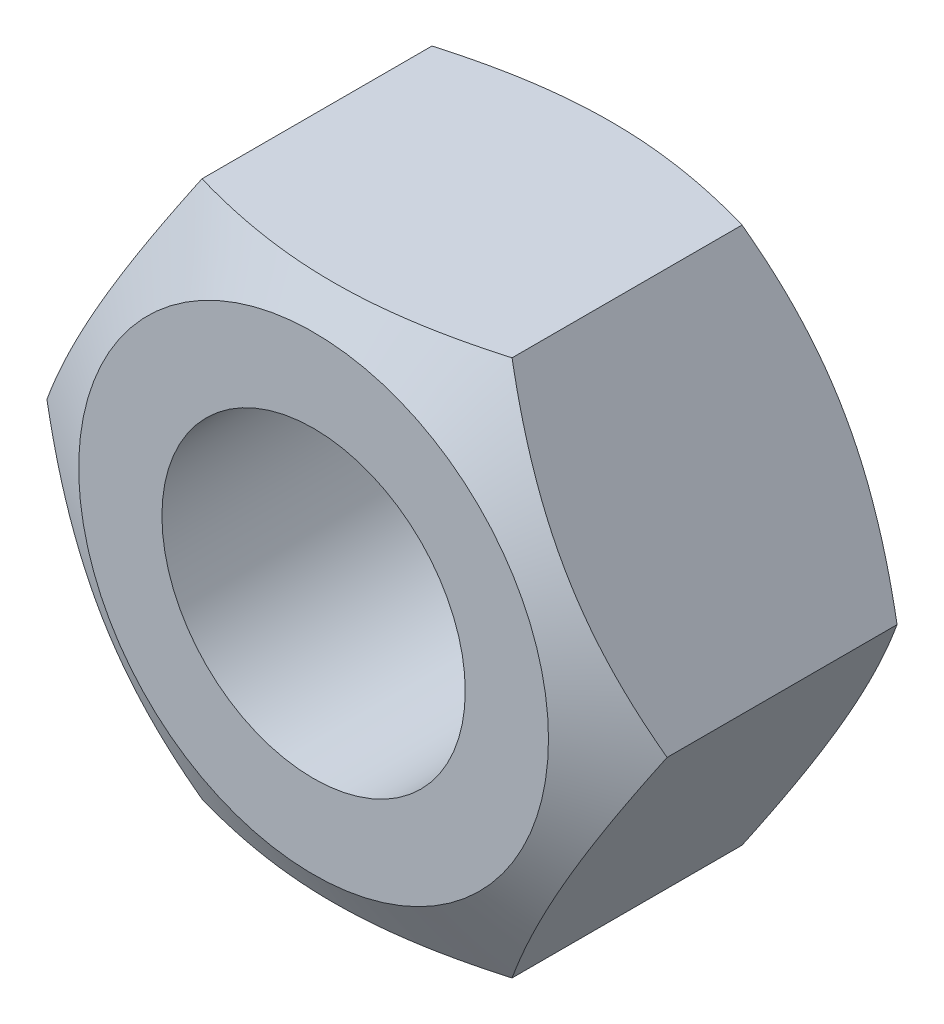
ISO-10303-21;
HEADER;
FILE_DESCRIPTION(('STEP AP214'),'2;1');
FILE_NAME('part.step','',(''),(''),'','','');
FILE_SCHEMA(('AUTOMOTIVE_DESIGN { 1 0 10303 214 1 1 1 1 }'));
ENDSEC;
DATA;
#1=APPLICATION_CONTEXT('core data for automotive mechanical design processes');
#2=APPLICATION_PROTOCOL_DEFINITION('international standard','automotive_design',2000,#1);
#3=PRODUCT_CONTEXT('',#1,'mechanical');
#4=PRODUCT('Part','Part','',(#3));
#5=PRODUCT_RELATED_PRODUCT_CATEGORY('part','',(#4));
#6=PRODUCT_DEFINITION_FORMATION('','',#4);
#7=PRODUCT_DEFINITION_CONTEXT('part definition',#1,'design');
#8=PRODUCT_DEFINITION('design','',#6,#7);
#9=PRODUCT_DEFINITION_SHAPE('','',#8);
#10=(LENGTH_UNIT() NAMED_UNIT(*) SI_UNIT(.MILLI.,.METRE.));
#11=(NAMED_UNIT(*) PLANE_ANGLE_UNIT() SI_UNIT($,.RADIAN.));
#12=(NAMED_UNIT(*) SI_UNIT($,.STERADIAN.) SOLID_ANGLE_UNIT());
#13=UNCERTAINTY_MEASURE_WITH_UNIT(LENGTH_MEASURE(1.E-05),#10,'distance_accuracy_value','');
#14=(GEOMETRIC_REPRESENTATION_CONTEXT(3) GLOBAL_UNCERTAINTY_ASSIGNED_CONTEXT((#13)) GLOBAL_UNIT_ASSIGNED_CONTEXT((#10,
#11,#12)) REPRESENTATION_CONTEXT('',''));
#15=CARTESIAN_POINT('',(0.,0.,0.));
#16=DIRECTION('',(0.,0.,1.));
#17=DIRECTION('',(1.,0.,0.));
#18=AXIS2_PLACEMENT_3D('',#15,#16,#17);
#19=CARTESIAN_POINT('',(0.,0.,0.644));
#20=DIRECTION('',(0.,0.,1.));
#21=DIRECTION('',(1.,0.,0.));
#22=AXIS2_PLACEMENT_3D('',#19,#20,#21);
#23=CONICAL_SURFACE('',#22,4.6,1.0471975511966);
#24=CARTESIAN_POINT('',(0.,0.,0.));
#25=DIRECTION('',(0.,0.,1.));
#26=DIRECTION('',(1.,0.,0.));
#27=AXIS2_PLACEMENT_3D('',#24,#25,#26);
#28=CIRCLE('',#27,3.48455927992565);
#29=CARTESIAN_POINT('',(3.48455927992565,0.,0.));
#30=VERTEX_POINT('',#29);
#31=EDGE_CURVE('E214',#30,#30,#28,.F.);
#32=ORIENTED_EDGE('',*,*,#31,.F.);
#33=EDGE_LOOP('',(#32));
#34=FACE_BOUND('',#33,.T.);
#35=CARTESIAN_POINT('',(2.29988452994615,3.98391685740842,0.644066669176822));
#36=CARTESIAN_POINT('',(2.40095754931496,3.80885325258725,0.585690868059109));
#37=CARTESIAN_POINT('',(2.50290302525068,3.63227850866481,0.532600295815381));
#38=CARTESIAN_POINT('',(2.70855925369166,3.27607147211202,0.439930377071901));
#39=CARTESIAN_POINT('',(2.81227366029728,3.09643285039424,0.400383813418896));
#40=CARTESIAN_POINT('',(3.01841713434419,2.73938187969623,0.338824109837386));
#41=CARTESIAN_POINT('',(3.12081448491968,2.56202446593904,0.316401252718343));
#42=CARTESIAN_POINT('',(3.32609097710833,2.20647515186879,0.289633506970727));
#43=CARTESIAN_POINT('',(3.42896937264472,2.0282845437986,0.28526645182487));
#44=CARTESIAN_POINT('',(3.62120183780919,1.69532814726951,0.294353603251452));
#45=CARTESIAN_POINT('',(3.71058469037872,1.54051250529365,0.305576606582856));
#46=CARTESIAN_POINT('',(3.88876806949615,1.23188983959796,0.341146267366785));
#47=CARTESIAN_POINT('',(3.97756797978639,1.07808388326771,0.365505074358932));
#48=CARTESIAN_POINT('',(4.15611871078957,0.768824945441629,0.426399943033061));
#49=CARTESIAN_POINT('',(4.2458469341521,0.613411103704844,0.463194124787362));
#50=CARTESIAN_POINT('',(4.42396513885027,0.304901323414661,0.54670234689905));
#51=CARTESIAN_POINT('',(4.51235740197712,0.151801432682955,0.593396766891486));
#52=CARTESIAN_POINT('',(4.60011547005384,-0.000200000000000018,0.644066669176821));
#53=B_SPLINE_CURVE_WITH_KNOTS('',3,(#35,#36,#37,#38,#39,#40,#41,#42,#43,#44,#45,#46,#47,#48,#49,
#50,#51,#52),.UNSPECIFIED.,.F.,.F.,(4,2,2,2,2,2,2,2,4),(0.,0.631466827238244,1.26445147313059,
1.8817701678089,2.49833077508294,3.03517287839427,3.57251237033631,4.12177063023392,
4.66995037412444),.UNSPECIFIED.);
#54=CARTESIAN_POINT('',(2.29999999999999,3.98371685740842,0.643999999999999));
#55=VERTEX_POINT('',#54);
#56=CARTESIAN_POINT('',(4.6,0.,0.644));
#57=VERTEX_POINT('',#56);
#58=EDGE_CURVE('E90',#55,#57,#53,.T.);
#59=ORIENTED_EDGE('',*,*,#58,.T.);
#60=CARTESIAN_POINT('',(4.60011547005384,0.0002,0.644066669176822));
#61=CARTESIAN_POINT('',(4.49904245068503,-0.174863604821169,0.585690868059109));
#62=CARTESIAN_POINT('',(4.39709697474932,-0.351438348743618,0.532600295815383));
#63=CARTESIAN_POINT('',(4.19144074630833,-0.707645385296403,0.439930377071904));
#64=CARTESIAN_POINT('',(4.08772633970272,-0.88728400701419,0.4003838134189));
#65=CARTESIAN_POINT('',(3.88158286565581,-1.2443349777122,0.338824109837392));
#66=CARTESIAN_POINT('',(3.77918551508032,-1.42169239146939,0.316401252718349));
#67=CARTESIAN_POINT('',(3.57390902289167,-1.77724170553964,0.289633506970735));
#68=CARTESIAN_POINT('',(3.47103062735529,-1.95543231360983,0.28526645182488));
#69=CARTESIAN_POINT('',(3.27879816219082,-2.28838871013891,0.294353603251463));
#70=CARTESIAN_POINT('',(3.18941530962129,-2.44320435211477,0.305576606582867));
#71=CARTESIAN_POINT('',(3.01123193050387,-2.75182701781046,0.341146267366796));
#72=CARTESIAN_POINT('',(2.92243202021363,-2.9056329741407,0.365505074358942));
#73=CARTESIAN_POINT('',(2.74388128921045,-3.21489191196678,0.426399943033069));
#74=CARTESIAN_POINT('',(2.65415306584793,-3.37030575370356,0.463194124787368));
#75=CARTESIAN_POINT('',(2.47603486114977,-3.67881553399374,0.546702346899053));
#76=CARTESIAN_POINT('',(2.38764259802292,-3.83191542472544,0.593396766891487));
#77=CARTESIAN_POINT('',(2.29988452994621,-3.98391685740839,0.644066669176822));
#78=B_SPLINE_CURVE_WITH_KNOTS('',3,(#60,#61,#62,#63,#64,#65,#66,#67,#68,#69,#70,#71,#72,#73,#74,
#75,#76,#77),.UNSPECIFIED.,.F.,.F.,(4,2,2,2,2,2,2,2,4),(0.,0.631466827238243,1.26445147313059,
1.8817701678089,2.49833077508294,3.03517287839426,3.57251237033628,4.12177063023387,
4.66995037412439),.UNSPECIFIED.);
#79=CARTESIAN_POINT('',(2.30000000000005,-3.98371685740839,0.644));
#80=VERTEX_POINT('',#79);
#81=EDGE_CURVE('E179',#57,#80,#78,.T.);
#82=ORIENTED_EDGE('',*,*,#81,.T.);
#83=CARTESIAN_POINT('',(-6.0600576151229,-3.98371685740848,2.17524414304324));
#84=CARTESIAN_POINT('',(-5.88700534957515,-3.98371685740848,2.09178000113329));
#85=CARTESIAN_POINT('',(-5.71354286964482,-3.98371685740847,2.00915113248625));
#86=CARTESIAN_POINT('',(-5.36557882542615,-3.98371685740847,1.84603631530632));
#87=CARTESIAN_POINT('',(-5.19107709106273,-3.98371685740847,1.76555073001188));
#88=CARTESIAN_POINT('',(-4.83985881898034,-3.98371685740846,1.60676430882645));
#89=CARTESIAN_POINT('',(-4.6631353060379,-3.98371685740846,1.52847884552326));
#90=CARTESIAN_POINT('',(-4.30824051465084,-3.98371685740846,1.3752739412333));
#91=CARTESIAN_POINT('',(-4.1300693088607,-3.98371685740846,1.30035433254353));
#92=CARTESIAN_POINT('',(-3.76674341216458,-3.98371685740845,1.15263847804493));
#93=CARTESIAN_POINT('',(-3.58153701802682,-3.98371685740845,1.07996867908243));
#94=CARTESIAN_POINT('',(-3.20891432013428,-3.98371685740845,0.940420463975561));
#95=CARTESIAN_POINT('',(-3.02149776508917,-3.98371685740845,0.873542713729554));
#96=CARTESIAN_POINT('',(-2.64454732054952,-3.98371685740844,0.747421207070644));
#97=CARTESIAN_POINT('',(-2.45501902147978,-3.98371685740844,0.6881609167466));
#98=CARTESIAN_POINT('',(-2.07324771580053,-3.98371685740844,0.57925304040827));
#99=CARTESIAN_POINT('',(-1.88100562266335,-3.98371685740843,0.529602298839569));
#100=CARTESIAN_POINT('',(-1.49472880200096,-3.98371685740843,0.442626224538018));
#101=CARTESIAN_POINT('',(-1.30070817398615,-3.98371685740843,0.405239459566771));
#102=CARTESIAN_POINT('',(-0.910383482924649,-3.98371685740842,0.344987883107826));
#103=CARTESIAN_POINT('',(-0.714079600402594,-3.98371685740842,0.322121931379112));
#104=CARTESIAN_POINT('',(-0.322680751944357,-3.98371685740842,0.293036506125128));
#105=CARTESIAN_POINT('',(-0.127601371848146,-3.98371685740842,0.286612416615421));
#106=CARTESIAN_POINT('',(0.262406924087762,-3.98371685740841,0.290423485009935));
#107=CARTESIAN_POINT('',(0.457335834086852,-3.98371685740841,0.300659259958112));
#108=CARTESIAN_POINT('',(0.791872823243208,-3.98371685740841,0.331817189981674));
#109=CARTESIAN_POINT('',(0.931848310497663,-3.98371685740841,0.348993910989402));
#110=CARTESIAN_POINT('',(1.21068944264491,-3.9837168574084,0.390802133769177));
#111=CARTESIAN_POINT('',(1.34955491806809,-3.9837168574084,0.415434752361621));
#112=CARTESIAN_POINT('',(1.76434873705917,-3.9837168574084,0.499212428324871));
#113=CARTESIAN_POINT('',(2.03830287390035,-3.98371685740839,0.568219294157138));
#114=CARTESIAN_POINT('',(2.44782308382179,-3.98371685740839,0.686799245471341));
#115=CARTESIAN_POINT('',(2.58553682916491,-3.98371685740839,0.729368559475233));
#116=CARTESIAN_POINT('',(2.85962528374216,-3.98371685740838,0.818657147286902));
#117=CARTESIAN_POINT('',(2.99599998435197,-3.98371685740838,0.865376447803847));
#118=CARTESIAN_POINT('',(3.26745921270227,-3.98371685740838,0.962238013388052));
#119=CARTESIAN_POINT('',(3.40254420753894,-3.98371685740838,1.01237898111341));
#120=CARTESIAN_POINT('',(3.67161322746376,-3.98371685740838,1.11552148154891));
#121=CARTESIAN_POINT('',(3.80559726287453,-3.98371685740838,1.16852298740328));
#122=CARTESIAN_POINT('',(4.11044155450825,-3.98371685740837,1.29227010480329));
#123=CARTESIAN_POINT('',(4.28098828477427,-3.98371685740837,1.363786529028));
#124=CARTESIAN_POINT('',(4.62073745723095,-3.98371685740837,1.50995090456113));
#125=CARTESIAN_POINT('',(4.78993983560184,-3.98371685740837,1.58459900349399));
#126=CARTESIAN_POINT('',(5.29591087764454,-3.98371685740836,1.81231195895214));
#127=CARTESIAN_POINT('',(5.6309914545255,-3.98371685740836,1.96912390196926));
#128=CARTESIAN_POINT('',(6.29823817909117,-3.98371685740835,2.28949405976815));
#129=CARTESIAN_POINT('',(6.63040154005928,-3.98371685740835,2.45305802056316));
#130=CARTESIAN_POINT('',(7.29242379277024,-3.98371685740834,2.7848000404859));
#131=CARTESIAN_POINT('',(7.62228261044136,-3.98371685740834,2.95297824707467));
#132=CARTESIAN_POINT('',(8.25466049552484,-3.98371685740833,3.27940856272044));
#133=CARTESIAN_POINT('',(8.55730763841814,-3.98371685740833,3.43741335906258));
#134=CARTESIAN_POINT('',(9.16148889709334,-3.98371685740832,3.75555530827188));
#135=CARTESIAN_POINT('',(9.46302298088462,-3.98371685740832,3.91569252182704));
#136=CARTESIAN_POINT('',(10.0645707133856,-3.98371685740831,4.23725971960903));
#137=CARTESIAN_POINT('',(10.3645862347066,-3.98371685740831,4.39868620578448));
#138=CARTESIAN_POINT('',(10.9638991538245,-3.9837168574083,4.7228334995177));
#139=CARTESIAN_POINT('',(11.263196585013,-3.9837168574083,4.88555424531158));
#140=CARTESIAN_POINT('',(11.562226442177,-3.98371685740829,5.0487619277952));
#141=B_SPLINE_CURVE_WITH_KNOTS('',3,(#83,#84,#85,#86,#87,#88,#89,#90,#91,#92,#93,#94,#95,#96,
#97,#98,#99,#100,#101,#102,#103,#104,#105,#106,#107,#108,#109,#110,#111,#112,#113,#114,#115,
#116,#117,#118,#119,#120,#121,#122,#123,#124,#125,#126,#127,#128,#129,#130,#131,#132,#133,#134,
#135,#136,#137,#138,#139,#140),.UNSPECIFIED.,.F.,.F.,(4,2,2,2,2,2,2,2,2,2,2,2,2,2,2,2,2,2,2,2,2,
2,2,2,2,2,2,2,4),(0.,0.576393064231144,1.15288320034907,1.73271577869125,2.31251943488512,
2.90930373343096,3.50615655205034,4.10169118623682,4.6970299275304,5.28933928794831,
5.88160213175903,6.46645771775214,7.05133496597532,7.47420386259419,7.89713613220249,
8.74351598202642,9.1759122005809,9.60831120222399,10.0405471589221,10.4727790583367,
11.0275413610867,11.5823298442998,12.6920756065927,13.8027860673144,14.9135320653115,
15.9377522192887,16.9620015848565,17.9840600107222,19.0060699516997),.UNSPECIFIED.);
#142=CARTESIAN_POINT('',(-2.29999999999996,-3.98371685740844,0.643999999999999));
#143=VERTEX_POINT('',#142);
#144=EDGE_CURVE('E173',#80,#143,#141,.F.);
#145=ORIENTED_EDGE('',*,*,#144,.T.);
#146=CARTESIAN_POINT('',(-2.29988452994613,-3.98391685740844,0.644066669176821));
#147=CARTESIAN_POINT('',(-2.40095754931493,-3.80885325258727,0.585690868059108));
#148=CARTESIAN_POINT('',(-2.50290302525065,-3.63227850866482,0.532600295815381));
#149=CARTESIAN_POINT('',(-2.70855925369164,-3.27607147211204,0.439930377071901));
#150=CARTESIAN_POINT('',(-2.81227366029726,-3.09643285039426,0.400383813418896));
#151=CARTESIAN_POINT('',(-3.01841713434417,-2.73938187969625,0.338824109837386));
#152=CARTESIAN_POINT('',(-3.12081448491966,-2.56202446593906,0.316401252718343));
#153=CARTESIAN_POINT('',(-3.32609097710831,-2.20647515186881,0.289633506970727));
#154=CARTESIAN_POINT('',(-3.4289693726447,-2.02828454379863,0.28526645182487));
#155=CARTESIAN_POINT('',(-3.62120183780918,-1.69532814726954,0.294353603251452));
#156=CARTESIAN_POINT('',(-3.71058469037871,-1.54051250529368,0.305576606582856));
#157=CARTESIAN_POINT('',(-3.88876806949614,-1.23188983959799,0.341146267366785));
#158=CARTESIAN_POINT('',(-3.97756797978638,-1.07808388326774,0.365505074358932));
#159=CARTESIAN_POINT('',(-4.15611871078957,-0.768824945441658,0.42639994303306));
#160=CARTESIAN_POINT('',(-4.2458469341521,-0.613411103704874,0.463194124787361));
#161=CARTESIAN_POINT('',(-4.42396513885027,-0.304901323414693,0.546702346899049));
#162=CARTESIAN_POINT('',(-4.51235740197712,-0.151801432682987,0.593396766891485));
#163=CARTESIAN_POINT('',(-4.60011547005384,0.000199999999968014,0.644066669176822));
#164=B_SPLINE_CURVE_WITH_KNOTS('',3,(#146,#147,#148,#149,#150,#151,#152,#153,#154,#155,#156,
#157,#158,#159,#160,#161,#162,#163),.UNSPECIFIED.,.F.,.F.,(4,2,2,2,2,2,2,2,4),(0.,
0.631466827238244,1.26445147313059,1.8817701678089,2.49833077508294,3.03517287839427,
3.57251237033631,4.12177063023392,4.66995037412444),.UNSPECIFIED.);
#165=CARTESIAN_POINT('',(-4.6,0.,0.644));
#166=VERTEX_POINT('',#165);
#167=EDGE_CURVE('E111',#143,#166,#164,.T.);
#168=ORIENTED_EDGE('',*,*,#167,.T.);
#169=CARTESIAN_POINT('',(-4.60011547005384,-0.000200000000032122,0.644066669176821));
#170=CARTESIAN_POINT('',(-4.49904245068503,0.174863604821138,0.585690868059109));
#171=CARTESIAN_POINT('',(-4.39709697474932,0.351438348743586,0.532600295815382));
#172=CARTESIAN_POINT('',(-4.19144074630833,0.70764538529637,0.439930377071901));
#173=CARTESIAN_POINT('',(-4.08772633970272,0.887284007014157,0.400383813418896));
#174=CARTESIAN_POINT('',(-3.88158286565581,1.24433497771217,0.338824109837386));
#175=CARTESIAN_POINT('',(-3.77918551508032,1.42169239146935,0.316401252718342));
#176=CARTESIAN_POINT('',(-3.57390902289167,1.77724170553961,0.289633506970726));
#177=CARTESIAN_POINT('',(-3.47103062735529,1.95543231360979,0.28526645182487));
#178=CARTESIAN_POINT('',(-3.27879816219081,2.28838871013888,0.294353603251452));
#179=CARTESIAN_POINT('',(-3.18941530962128,2.44320435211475,0.305576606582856));
#180=CARTESIAN_POINT('',(-3.01123193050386,2.75182701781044,0.341146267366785));
#181=CARTESIAN_POINT('',(-2.92243202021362,2.90563297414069,0.365505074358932));
#182=CARTESIAN_POINT('',(-2.74388128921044,3.21489191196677,0.426399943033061));
#183=CARTESIAN_POINT('',(-2.65415306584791,3.37030575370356,0.463194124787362));
#184=CARTESIAN_POINT('',(-2.47603486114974,3.67881553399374,0.54670234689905));
#185=CARTESIAN_POINT('',(-2.38764259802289,3.83191542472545,0.593396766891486));
#186=CARTESIAN_POINT('',(-2.29988452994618,3.98391685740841,0.644066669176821));
#187=B_SPLINE_CURVE_WITH_KNOTS('',3,(#169,#170,#171,#172,#173,#174,#175,#176,#177,#178,#179,
#180,#181,#182,#183,#184,#185,#186),.UNSPECIFIED.,.F.,.F.,(4,2,2,2,2,2,2,2,4),(0.,
0.631466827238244,1.26445147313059,1.8817701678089,2.49833077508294,3.03517287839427,
3.57251237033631,4.12177063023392,4.66995037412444),.UNSPECIFIED.);
#188=CARTESIAN_POINT('',(-2.30000000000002,3.98371685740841,0.643999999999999));
#189=VERTEX_POINT('',#188);
#190=EDGE_CURVE('E109',#166,#189,#187,.T.);
#191=ORIENTED_EDGE('',*,*,#190,.T.);
#192=CARTESIAN_POINT('',(-6.06005761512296,3.98371685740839,2.17524414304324));
#193=CARTESIAN_POINT('',(-5.8870053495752,3.98371685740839,2.09178000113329));
#194=CARTESIAN_POINT('',(-5.71354286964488,3.98371685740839,2.00915113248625));
#195=CARTESIAN_POINT('',(-5.3655788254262,3.9837168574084,1.84603631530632));
#196=CARTESIAN_POINT('',(-5.19107709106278,3.9837168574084,1.76555073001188));
#197=CARTESIAN_POINT('',(-4.83985881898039,3.9837168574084,1.60676430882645));
#198=CARTESIAN_POINT('',(-4.66313530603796,3.9837168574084,1.52847884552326));
#199=CARTESIAN_POINT('',(-4.3082405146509,3.9837168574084,1.3752739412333));
#200=CARTESIAN_POINT('',(-4.13006930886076,3.9837168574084,1.30035433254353));
#201=CARTESIAN_POINT('',(-3.76674341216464,3.9837168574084,1.15263847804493));
#202=CARTESIAN_POINT('',(-3.58153701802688,3.9837168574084,1.07996867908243));
#203=CARTESIAN_POINT('',(-3.20891432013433,3.9837168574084,0.940420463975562));
#204=CARTESIAN_POINT('',(-3.02149776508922,3.9837168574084,0.873542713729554));
#205=CARTESIAN_POINT('',(-2.64454732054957,3.98371685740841,0.747421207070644));
#206=CARTESIAN_POINT('',(-2.45501902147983,3.98371685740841,0.688160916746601));
#207=CARTESIAN_POINT('',(-2.07324771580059,3.98371685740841,0.579253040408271));
#208=CARTESIAN_POINT('',(-1.88100562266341,3.98371685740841,0.529602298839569));
#209=CARTESIAN_POINT('',(-1.49472880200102,3.98371685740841,0.442626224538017));
#210=CARTESIAN_POINT('',(-1.30070817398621,3.98371685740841,0.405239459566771));
#211=CARTESIAN_POINT('',(-0.910383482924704,3.98371685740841,0.344987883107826));
#212=CARTESIAN_POINT('',(-0.714079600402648,3.98371685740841,0.322121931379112));
#213=CARTESIAN_POINT('',(-0.322680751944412,3.98371685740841,0.293036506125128));
#214=CARTESIAN_POINT('',(-0.127601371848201,3.98371685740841,0.286612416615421));
#215=CARTESIAN_POINT('',(0.262406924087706,3.98371685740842,0.290423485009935));
#216=CARTESIAN_POINT('',(0.457335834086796,3.98371685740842,0.300659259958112));
#217=CARTESIAN_POINT('',(0.791872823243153,3.98371685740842,0.331817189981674));
#218=CARTESIAN_POINT('',(0.931848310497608,3.98371685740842,0.348993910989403));
#219=CARTESIAN_POINT('',(1.21068944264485,3.98371685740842,0.390802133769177));
#220=CARTESIAN_POINT('',(1.34955491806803,3.98371685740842,0.415434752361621));
#221=CARTESIAN_POINT('',(1.76434873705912,3.98371685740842,0.499212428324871));
#222=CARTESIAN_POINT('',(2.03830287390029,3.98371685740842,0.568219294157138));
#223=CARTESIAN_POINT('',(2.44782308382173,3.98371685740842,0.68679924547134));
#224=CARTESIAN_POINT('',(2.58553682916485,3.98371685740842,0.729368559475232));
#225=CARTESIAN_POINT('',(2.8596252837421,3.98371685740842,0.818657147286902));
#226=CARTESIAN_POINT('',(2.99599998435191,3.98371685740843,0.865376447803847));
#227=CARTESIAN_POINT('',(3.26745921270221,3.98371685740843,0.962238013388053));
#228=CARTESIAN_POINT('',(3.40254420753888,3.98371685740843,1.01237898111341));
#229=CARTESIAN_POINT('',(3.67161322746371,3.98371685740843,1.11552148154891));
#230=CARTESIAN_POINT('',(3.80559726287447,3.98371685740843,1.16852298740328));
#231=CARTESIAN_POINT('',(4.1104415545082,3.98371685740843,1.29227010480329));
#232=CARTESIAN_POINT('',(4.28098828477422,3.98371685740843,1.363786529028));
#233=CARTESIAN_POINT('',(4.62073745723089,3.98371685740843,1.50995090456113));
#234=CARTESIAN_POINT('',(4.78993983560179,3.98371685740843,1.58459900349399));
#235=CARTESIAN_POINT('',(5.29591087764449,3.98371685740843,1.81231195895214));
#236=CARTESIAN_POINT('',(5.63099145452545,3.98371685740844,1.96912390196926));
#237=CARTESIAN_POINT('',(6.29823817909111,3.98371685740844,2.28949405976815));
#238=CARTESIAN_POINT('',(6.63040154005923,3.98371685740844,2.45305802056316));
#239=CARTESIAN_POINT('',(7.29242379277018,3.98371685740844,2.7848000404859));
#240=CARTESIAN_POINT('',(7.62228261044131,3.98371685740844,2.95297824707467));
#241=CARTESIAN_POINT('',(8.25466049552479,3.98371685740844,3.27940856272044));
#242=CARTESIAN_POINT('',(8.55730763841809,3.98371685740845,3.43741335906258));
#243=CARTESIAN_POINT('',(9.16148889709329,3.98371685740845,3.75555530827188));
#244=CARTESIAN_POINT('',(9.46302298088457,3.98371685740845,3.91569252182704));
#245=CARTESIAN_POINT('',(10.0645707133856,3.98371685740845,4.23725971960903));
#246=CARTESIAN_POINT('',(10.3645862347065,3.98371685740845,4.39868620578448));
#247=CARTESIAN_POINT('',(10.9638991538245,3.98371685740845,4.7228334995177));
#248=CARTESIAN_POINT('',(11.263196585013,3.98371685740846,4.88555424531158));
#249=CARTESIAN_POINT('',(11.5622264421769,3.98371685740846,5.0487619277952));
#250=B_SPLINE_CURVE_WITH_KNOTS('',3,(#192,#193,#194,#195,#196,#197,#198,#199,#200,#201,#202,
#203,#204,#205,#206,#207,#208,#209,#210,#211,#212,#213,#214,#215,#216,#217,#218,#219,#220,#221,
#222,#223,#224,#225,#226,#227,#228,#229,#230,#231,#232,#233,#234,#235,#236,#237,#238,#239,#240,
#241,#242,#243,#244,#245,#246,#247,#248,#249),.UNSPECIFIED.,.F.,.F.,(4,2,2,2,2,2,2,2,2,2,2,2,2,
2,2,2,2,2,2,2,2,2,2,2,2,2,2,2,4),(0.,0.576393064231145,1.15288320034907,1.73271577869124,
2.31251943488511,2.90930373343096,3.50615655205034,4.10169118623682,4.6970299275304,
5.28933928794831,5.88160213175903,6.46645771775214,7.05133496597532,7.4742038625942,
7.89713613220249,8.74351598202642,9.1759122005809,9.60831120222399,10.0405471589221,
10.4727790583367,11.0275413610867,11.5823298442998,12.6920756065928,13.8027860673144,
14.9135320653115,15.9377522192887,16.9620015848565,17.9840600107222,19.0060699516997),.UNSPECIFIED.);
#251=EDGE_CURVE('E95',#189,#55,#250,.T.);
#252=ORIENTED_EDGE('',*,*,#251,.T.);
#253=EDGE_LOOP('',(#59,#82,#145,#168,#191,#252));
#254=FACE_BOUND('',#253,.T.);
#255=ADVANCED_FACE('F35',(#34,#254),#23,.T.);
#256=CARTESIAN_POINT('',(0.,0.,4.7));
#257=DIRECTION('',(0.,0.,-1.));
#258=DIRECTION('',(-1.,0.,0.));
#259=AXIS2_PLACEMENT_3D('',#256,#257,#258);
#260=CONICAL_SURFACE('',#259,3.48455927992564,1.0471975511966);
#261=CARTESIAN_POINT('',(0.,0.,4.7));
#262=DIRECTION('',(0.,0.,1.));
#263=DIRECTION('',(1.,0.,0.));
#264=AXIS2_PLACEMENT_3D('',#261,#262,#263);
#265=CIRCLE('',#264,3.48455927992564);
#266=CARTESIAN_POINT('',(3.48455927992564,0.,4.7));
#267=VERTEX_POINT('',#266);
#268=EDGE_CURVE('E215',#267,#267,#265,.T.);
#269=ORIENTED_EDGE('',*,*,#268,.F.);
#270=EDGE_LOOP('',(#269));
#271=FACE_BOUND('',#270,.T.);
#272=CARTESIAN_POINT('',(-6.0600576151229,-3.98371685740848,2.52475585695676));
#273=CARTESIAN_POINT('',(-5.88700534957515,-3.98371685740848,2.60821999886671));
#274=CARTESIAN_POINT('',(-5.71354286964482,-3.98371685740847,2.69084886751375));
#275=CARTESIAN_POINT('',(-5.36557882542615,-3.98371685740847,2.85396368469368));
#276=CARTESIAN_POINT('',(-5.19107709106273,-3.98371685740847,2.93444926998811));
#277=CARTESIAN_POINT('',(-4.83985881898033,-3.98371685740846,3.09323569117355));
#278=CARTESIAN_POINT('',(-4.6631353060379,-3.98371685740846,3.17152115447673));
#279=CARTESIAN_POINT('',(-4.30824051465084,-3.98371685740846,3.3247260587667));
#280=CARTESIAN_POINT('',(-4.1300693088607,-3.98371685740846,3.39964566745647));
#281=CARTESIAN_POINT('',(-3.76674341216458,-3.98371685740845,3.54736152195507));
#282=CARTESIAN_POINT('',(-3.58153701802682,-3.98371685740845,3.62003132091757));
#283=CARTESIAN_POINT('',(-3.20891432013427,-3.98371685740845,3.75957953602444));
#284=CARTESIAN_POINT('',(-3.02149776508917,-3.98371685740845,3.82645728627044));
#285=CARTESIAN_POINT('',(-2.64454732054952,-3.98371685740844,3.95257879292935));
#286=CARTESIAN_POINT('',(-2.45501902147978,-3.98371685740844,4.0118390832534));
#287=CARTESIAN_POINT('',(-2.07324771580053,-3.98371685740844,4.12074695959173));
#288=CARTESIAN_POINT('',(-1.88100562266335,-3.98371685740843,4.17039770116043));
#289=CARTESIAN_POINT('',(-1.49472880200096,-3.98371685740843,4.25737377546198));
#290=CARTESIAN_POINT('',(-1.30070817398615,-3.98371685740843,4.29476054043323));
#291=CARTESIAN_POINT('',(-0.910383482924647,-3.98371685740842,4.35501211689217));
#292=CARTESIAN_POINT('',(-0.714079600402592,-3.98371685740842,4.37787806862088));
#293=CARTESIAN_POINT('',(-0.322680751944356,-3.98371685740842,4.40696349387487));
#294=CARTESIAN_POINT('',(-0.127601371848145,-3.98371685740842,4.41338758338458));
#295=CARTESIAN_POINT('',(0.262406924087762,-3.98371685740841,4.40957651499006));
#296=CARTESIAN_POINT('',(0.457335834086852,-3.98371685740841,4.39934074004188));
#297=CARTESIAN_POINT('',(0.791872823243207,-3.98371685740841,4.36818281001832));
#298=CARTESIAN_POINT('',(0.931848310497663,-3.98371685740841,4.35100608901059));
#299=CARTESIAN_POINT('',(1.21068944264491,-3.9837168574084,4.30919786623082));
#300=CARTESIAN_POINT('',(1.34955491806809,-3.9837168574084,4.28456524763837));
#301=CARTESIAN_POINT('',(1.76434873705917,-3.9837168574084,4.20078757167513));
#302=CARTESIAN_POINT('',(2.03830287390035,-3.98371685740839,4.13178070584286));
#303=CARTESIAN_POINT('',(2.44782308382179,-3.98371685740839,4.01320075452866));
#304=CARTESIAN_POINT('',(2.58553682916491,-3.98371685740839,3.97063144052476));
#305=CARTESIAN_POINT('',(2.85962528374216,-3.98371685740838,3.88134285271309));
#306=CARTESIAN_POINT('',(2.99599998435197,-3.98371685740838,3.83462355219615));
#307=CARTESIAN_POINT('',(3.26745921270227,-3.98371685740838,3.73776198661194));
#308=CARTESIAN_POINT('',(3.40254420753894,-3.98371685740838,3.68762101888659));
#309=CARTESIAN_POINT('',(3.67161322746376,-3.98371685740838,3.58447851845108));
#310=CARTESIAN_POINT('',(3.80559726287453,-3.98371685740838,3.53147701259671));
#311=CARTESIAN_POINT('',(4.11044155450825,-3.98371685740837,3.40772989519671));
#312=CARTESIAN_POINT('',(4.28098828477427,-3.98371685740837,3.336213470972));
#313=CARTESIAN_POINT('',(4.62073745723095,-3.98371685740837,3.19004909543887));
#314=CARTESIAN_POINT('',(4.78993983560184,-3.98371685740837,3.11540099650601));
#315=CARTESIAN_POINT('',(5.29591087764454,-3.98371685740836,2.88768804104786));
#316=CARTESIAN_POINT('',(5.6309914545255,-3.98371685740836,2.73087609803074));
#317=CARTESIAN_POINT('',(6.29823817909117,-3.98371685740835,2.41050594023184));
#318=CARTESIAN_POINT('',(6.63040154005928,-3.98371685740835,2.24694197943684));
#319=CARTESIAN_POINT('',(7.29242379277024,-3.98371685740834,1.91519995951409));
#320=CARTESIAN_POINT('',(7.62228261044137,-3.98371685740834,1.74702175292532));
#321=CARTESIAN_POINT('',(8.25466049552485,-3.98371685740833,1.42059143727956));
#322=CARTESIAN_POINT('',(8.55730763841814,-3.98371685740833,1.26258664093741));
#323=CARTESIAN_POINT('',(9.16148889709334,-3.98371685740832,0.94444469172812));
#324=CARTESIAN_POINT('',(9.46302298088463,-3.98371685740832,0.784307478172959));
#325=CARTESIAN_POINT('',(10.0645707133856,-3.98371685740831,0.462740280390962));
#326=CARTESIAN_POINT('',(10.3645862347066,-3.98371685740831,0.301313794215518));
#327=CARTESIAN_POINT('',(10.9638991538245,-3.9837168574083,-0.0228334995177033));
#328=CARTESIAN_POINT('',(11.263196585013,-3.9837168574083,-0.185554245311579));
#329=CARTESIAN_POINT('',(11.562226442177,-3.98371685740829,-0.348761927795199));
#330=B_SPLINE_CURVE_WITH_KNOTS('',3,(#272,#273,#274,#275,#276,#277,#278,#279,#280,#281,#282,
#283,#284,#285,#286,#287,#288,#289,#290,#291,#292,#293,#294,#295,#296,#297,#298,#299,#300,#301,
#302,#303,#304,#305,#306,#307,#308,#309,#310,#311,#312,#313,#314,#315,#316,#317,#318,#319,#320,
#321,#322,#323,#324,#325,#326,#327,#328,#329),.UNSPECIFIED.,.F.,.F.,(4,2,2,2,2,2,2,2,2,2,2,2,2,
2,2,2,2,2,2,2,2,2,2,2,2,2,2,2,4),(0.,0.576393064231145,1.15288320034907,1.73271577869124,
2.31251943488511,2.90930373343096,3.50615655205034,4.10169118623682,4.6970299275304,
5.28933928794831,5.88160213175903,6.46645771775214,7.05133496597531,7.47420386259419,
7.89713613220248,8.74351598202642,9.1759122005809,9.60831120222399,10.0405471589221,
10.4727790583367,11.0275413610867,11.5823298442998,12.6920756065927,13.8027860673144,
14.9135320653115,15.9377522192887,16.9620015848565,17.9840600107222,19.0060699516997),.UNSPECIFIED.);
#331=CARTESIAN_POINT('',(-2.29999999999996,-3.98371685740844,4.056));
#332=VERTEX_POINT('',#331);
#333=CARTESIAN_POINT('',(2.30000000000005,-3.98371685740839,4.056));
#334=VERTEX_POINT('',#333);
#335=EDGE_CURVE('E48',#332,#334,#330,.T.);
#336=ORIENTED_EDGE('',*,*,#335,.T.);
#337=CARTESIAN_POINT('',(2.29988452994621,-3.98391685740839,4.05593333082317));
#338=CARTESIAN_POINT('',(2.40095754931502,-3.80885325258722,4.11430913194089));
#339=CARTESIAN_POINT('',(2.50290302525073,-3.63227850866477,4.16739970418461));
#340=CARTESIAN_POINT('',(2.70855925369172,-3.27607147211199,4.26006962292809));
#341=CARTESIAN_POINT('',(2.81227366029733,-3.0964328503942,4.2996161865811));
#342=CARTESIAN_POINT('',(3.01841713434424,-2.73938187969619,4.3611758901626));
#343=CARTESIAN_POINT('',(3.12081448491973,-2.562024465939,4.38359874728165));
#344=CARTESIAN_POINT('',(3.32609097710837,-2.20647515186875,4.41036649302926));
#345=CARTESIAN_POINT('',(3.42896937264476,-2.02828454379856,4.41473354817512));
#346=CARTESIAN_POINT('',(3.62120183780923,-1.69532814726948,4.40564639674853));
#347=CARTESIAN_POINT('',(3.71058469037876,-1.54051250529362,4.39442339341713));
#348=CARTESIAN_POINT('',(3.88876806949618,-1.23188983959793,4.3588537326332));
#349=CARTESIAN_POINT('',(3.97756797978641,-1.07808388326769,4.33449492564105));
#350=CARTESIAN_POINT('',(4.15611871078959,-0.768824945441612,4.27360005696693));
#351=CARTESIAN_POINT('',(4.24584693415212,-0.613411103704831,4.23680587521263));
#352=CARTESIAN_POINT('',(4.42396513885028,-0.304901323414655,4.15329765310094));
#353=CARTESIAN_POINT('',(4.51235740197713,-0.151801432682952,4.10660323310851));
#354=CARTESIAN_POINT('',(4.60011547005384,0.000199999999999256,4.05593333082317));
#355=B_SPLINE_CURVE_WITH_KNOTS('',3,(#337,#338,#339,#340,#341,#342,#343,#344,#345,#346,#347,
#348,#349,#350,#351,#352,#353,#354),.UNSPECIFIED.,.F.,.F.,(4,2,2,2,2,2,2,2,4),(0.,
0.631466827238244,1.26445147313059,1.8817701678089,2.49833077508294,3.03517287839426,
3.57251237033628,4.12177063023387,4.66995037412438),.UNSPECIFIED.);
#356=CARTESIAN_POINT('',(4.6,0.,4.056));
#357=VERTEX_POINT('',#356);
#358=EDGE_CURVE('E12',#334,#357,#355,.T.);
#359=ORIENTED_EDGE('',*,*,#358,.T.);
#360=CARTESIAN_POINT('',(4.60011547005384,-0.000200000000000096,4.05593333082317));
#361=CARTESIAN_POINT('',(4.49904245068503,0.174863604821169,4.11430913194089));
#362=CARTESIAN_POINT('',(4.39709697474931,0.351438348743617,4.16739970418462));
#363=CARTESIAN_POINT('',(4.19144074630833,0.707645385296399,4.2600696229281));
#364=CARTESIAN_POINT('',(4.08772633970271,0.887284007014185,4.2996161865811));
#365=CARTESIAN_POINT('',(3.8815828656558,1.24433497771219,4.36117589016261));
#366=CARTESIAN_POINT('',(3.77918551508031,1.42169239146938,4.38359874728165));
#367=CARTESIAN_POINT('',(3.57390902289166,1.77724170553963,4.41036649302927));
#368=CARTESIAN_POINT('',(3.47103062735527,1.95543231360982,4.41473354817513));
#369=CARTESIAN_POINT('',(3.2787981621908,2.28838871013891,4.40564639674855));
#370=CARTESIAN_POINT('',(3.18941530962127,2.44320435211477,4.39442339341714));
#371=CARTESIAN_POINT('',(3.01123193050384,2.75182701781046,4.35885373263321));
#372=CARTESIAN_POINT('',(2.9224320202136,2.90563297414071,4.33449492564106));
#373=CARTESIAN_POINT('',(2.74388128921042,3.21489191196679,4.27360005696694));
#374=CARTESIAN_POINT('',(2.65415306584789,3.37030575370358,4.23680587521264));
#375=CARTESIAN_POINT('',(2.47603486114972,3.67881553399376,4.15329765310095));
#376=CARTESIAN_POINT('',(2.38764259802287,3.83191542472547,4.10660323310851));
#377=CARTESIAN_POINT('',(2.29988452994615,3.98391685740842,4.05593333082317));
#378=B_SPLINE_CURVE_WITH_KNOTS('',3,(#360,#361,#362,#363,#364,#365,#366,#367,#368,#369,#370,
#371,#372,#373,#374,#375,#376,#377),.UNSPECIFIED.,.F.,.F.,(4,2,2,2,2,2,2,2,4),(0.,
0.631466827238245,1.26445147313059,1.8817701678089,2.49833077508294,3.03517287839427,
3.57251237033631,4.12177063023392,4.66995037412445),.UNSPECIFIED.);
#379=CARTESIAN_POINT('',(2.29999999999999,3.98371685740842,4.056));
#380=VERTEX_POINT('',#379);
#381=EDGE_CURVE('E143',#357,#380,#378,.T.);
#382=ORIENTED_EDGE('',*,*,#381,.T.);
#383=CARTESIAN_POINT('',(-6.06005761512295,3.98371685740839,2.52475585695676));
#384=CARTESIAN_POINT('',(-5.8870053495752,3.98371685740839,2.60821999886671));
#385=CARTESIAN_POINT('',(-5.71354286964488,3.98371685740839,2.69084886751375));
#386=CARTESIAN_POINT('',(-5.3655788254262,3.9837168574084,2.85396368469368));
#387=CARTESIAN_POINT('',(-5.19107709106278,3.9837168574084,2.93444926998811));
#388=CARTESIAN_POINT('',(-4.83985881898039,3.9837168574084,3.09323569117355));
#389=CARTESIAN_POINT('',(-4.66313530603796,3.9837168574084,3.17152115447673));
#390=CARTESIAN_POINT('',(-4.3082405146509,3.9837168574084,3.3247260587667));
#391=CARTESIAN_POINT('',(-4.13006930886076,3.9837168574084,3.39964566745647));
#392=CARTESIAN_POINT('',(-3.76674341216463,3.9837168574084,3.54736152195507));
#393=CARTESIAN_POINT('',(-3.58153701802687,3.9837168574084,3.62003132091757));
#394=CARTESIAN_POINT('',(-3.20891432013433,3.9837168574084,3.75957953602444));
#395=CARTESIAN_POINT('',(-3.02149776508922,3.9837168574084,3.82645728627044));
#396=CARTESIAN_POINT('',(-2.64454732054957,3.98371685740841,3.95257879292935));
#397=CARTESIAN_POINT('',(-2.45501902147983,3.98371685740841,4.0118390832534));
#398=CARTESIAN_POINT('',(-2.07324771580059,3.98371685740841,4.12074695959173));
#399=CARTESIAN_POINT('',(-1.8810056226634,3.98371685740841,4.17039770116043));
#400=CARTESIAN_POINT('',(-1.49472880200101,3.98371685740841,4.25737377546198));
#401=CARTESIAN_POINT('',(-1.30070817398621,3.98371685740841,4.29476054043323));
#402=CARTESIAN_POINT('',(-0.910383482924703,3.98371685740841,4.35501211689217));
#403=CARTESIAN_POINT('',(-0.714079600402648,3.98371685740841,4.37787806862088));
#404=CARTESIAN_POINT('',(-0.322680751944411,3.98371685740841,4.40696349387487));
#405=CARTESIAN_POINT('',(-0.1276013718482,3.98371685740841,4.41338758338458));
#406=CARTESIAN_POINT('',(0.262406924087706,3.98371685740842,4.40957651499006));
#407=CARTESIAN_POINT('',(0.457335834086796,3.98371685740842,4.39934074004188));
#408=CARTESIAN_POINT('',(0.791872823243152,3.98371685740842,4.36818281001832));
#409=CARTESIAN_POINT('',(0.931848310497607,3.98371685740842,4.35100608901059));
#410=CARTESIAN_POINT('',(1.21068944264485,3.98371685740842,4.30919786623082));
#411=CARTESIAN_POINT('',(1.34955491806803,3.98371685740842,4.28456524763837));
#412=CARTESIAN_POINT('',(1.76434873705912,3.98371685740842,4.20078757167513));
#413=CARTESIAN_POINT('',(2.03830287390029,3.98371685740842,4.13178070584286));
#414=CARTESIAN_POINT('',(2.44782308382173,3.98371685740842,4.01320075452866));
#415=CARTESIAN_POINT('',(2.58553682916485,3.98371685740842,3.97063144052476));
#416=CARTESIAN_POINT('',(2.8596252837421,3.98371685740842,3.8813428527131));
#417=CARTESIAN_POINT('',(2.99599998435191,3.98371685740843,3.83462355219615));
#418=CARTESIAN_POINT('',(3.26745921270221,3.98371685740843,3.73776198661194));
#419=CARTESIAN_POINT('',(3.40254420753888,3.98371685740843,3.68762101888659));
#420=CARTESIAN_POINT('',(3.67161322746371,3.98371685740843,3.58447851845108));
#421=CARTESIAN_POINT('',(3.80559726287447,3.98371685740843,3.53147701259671));
#422=CARTESIAN_POINT('',(4.1104415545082,3.98371685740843,3.40772989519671));
#423=CARTESIAN_POINT('',(4.28098828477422,3.98371685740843,3.336213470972));
#424=CARTESIAN_POINT('',(4.62073745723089,3.98371685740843,3.19004909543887));
#425=CARTESIAN_POINT('',(4.78993983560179,3.98371685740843,3.11540099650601));
#426=CARTESIAN_POINT('',(5.29591087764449,3.98371685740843,2.88768804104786));
#427=CARTESIAN_POINT('',(5.63099145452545,3.98371685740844,2.73087609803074));
#428=CARTESIAN_POINT('',(6.29823817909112,3.98371685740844,2.41050594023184));
#429=CARTESIAN_POINT('',(6.63040154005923,3.98371685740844,2.24694197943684));
#430=CARTESIAN_POINT('',(7.29242379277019,3.98371685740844,1.91519995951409));
#431=CARTESIAN_POINT('',(7.62228261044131,3.98371685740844,1.74702175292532));
#432=CARTESIAN_POINT('',(8.25466049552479,3.98371685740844,1.42059143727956));
#433=CARTESIAN_POINT('',(8.55730763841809,3.98371685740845,1.26258664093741));
#434=CARTESIAN_POINT('',(9.16148889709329,3.98371685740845,0.94444469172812));
#435=CARTESIAN_POINT('',(9.46302298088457,3.98371685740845,0.784307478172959));
#436=CARTESIAN_POINT('',(10.0645707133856,3.98371685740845,0.462740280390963));
#437=CARTESIAN_POINT('',(10.3645862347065,3.98371685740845,0.30131379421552));
#438=CARTESIAN_POINT('',(10.9638991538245,3.98371685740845,-0.0228334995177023));
#439=CARTESIAN_POINT('',(11.263196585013,3.98371685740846,-0.185554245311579));
#440=CARTESIAN_POINT('',(11.5622264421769,3.98371685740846,-0.348761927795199));
#441=B_SPLINE_CURVE_WITH_KNOTS('',3,(#383,#384,#385,#386,#387,#388,#389,#390,#391,#392,#393,
#394,#395,#396,#397,#398,#399,#400,#401,#402,#403,#404,#405,#406,#407,#408,#409,#410,#411,#412,
#413,#414,#415,#416,#417,#418,#419,#420,#421,#422,#423,#424,#425,#426,#427,#428,#429,#430,#431,
#432,#433,#434,#435,#436,#437,#438,#439,#440),.UNSPECIFIED.,.F.,.F.,(4,2,2,2,2,2,2,2,2,2,2,2,2,
2,2,2,2,2,2,2,2,2,2,2,2,2,2,2,4),(0.,0.576393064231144,1.15288320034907,1.73271577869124,
2.31251943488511,2.90930373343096,3.50615655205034,4.10169118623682,4.6970299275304,
5.28933928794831,5.88160213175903,6.46645771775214,7.05133496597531,7.47420386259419,
7.89713613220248,8.74351598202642,9.1759122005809,9.60831120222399,10.0405471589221,
10.4727790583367,11.0275413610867,11.5823298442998,12.6920756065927,13.8027860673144,
14.9135320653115,15.9377522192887,16.9620015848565,17.9840600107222,19.0060699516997),.UNSPECIFIED.);
#442=CARTESIAN_POINT('',(-2.30000000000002,3.98371685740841,4.056));
#443=VERTEX_POINT('',#442);
#444=EDGE_CURVE('E103',#380,#443,#441,.F.);
#445=ORIENTED_EDGE('',*,*,#444,.T.);
#446=CARTESIAN_POINT('',(-2.29988452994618,3.98391685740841,4.05593333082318));
#447=CARTESIAN_POINT('',(-2.40095754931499,3.80885325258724,4.11430913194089));
#448=CARTESIAN_POINT('',(-2.5029030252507,3.63227850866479,4.16739970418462));
#449=CARTESIAN_POINT('',(-2.70855925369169,3.276071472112,4.2600696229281));
#450=CARTESIAN_POINT('',(-2.8122736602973,3.09643285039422,4.2996161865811));
#451=CARTESIAN_POINT('',(-3.01841713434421,2.73938187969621,4.36117589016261));
#452=CARTESIAN_POINT('',(-3.1208144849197,2.56202446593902,4.38359874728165));
#453=CARTESIAN_POINT('',(-3.32609097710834,2.20647515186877,4.41036649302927));
#454=CARTESIAN_POINT('',(-3.42896937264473,2.02828454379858,4.41473354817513));
#455=CARTESIAN_POINT('',(-3.6212018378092,1.69532814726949,4.40564639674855));
#456=CARTESIAN_POINT('',(-3.71058469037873,1.54051250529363,4.39442339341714));
#457=CARTESIAN_POINT('',(-3.88876806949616,1.23188983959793,4.35885373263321));
#458=CARTESIAN_POINT('',(-3.97756797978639,1.07808388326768,4.33449492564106));
#459=CARTESIAN_POINT('',(-4.15611871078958,0.768824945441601,4.27360005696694));
#460=CARTESIAN_POINT('',(-4.24584693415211,0.613411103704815,4.23680587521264));
#461=CARTESIAN_POINT('',(-4.42396513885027,0.30490132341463,4.15329765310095));
#462=CARTESIAN_POINT('',(-4.51235740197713,0.151801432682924,4.10660323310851));
#463=CARTESIAN_POINT('',(-4.60011547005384,-0.000200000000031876,4.05593333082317));
#464=B_SPLINE_CURVE_WITH_KNOTS('',3,(#446,#447,#448,#449,#450,#451,#452,#453,#454,#455,#456,
#457,#458,#459,#460,#461,#462,#463),.UNSPECIFIED.,.F.,.F.,(4,2,2,2,2,2,2,2,4),(0.,
0.631466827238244,1.26445147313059,1.8817701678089,2.49833077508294,3.03517287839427,
3.57251237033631,4.12177063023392,4.66995037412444),.UNSPECIFIED.);
#465=CARTESIAN_POINT('',(-4.6,0.,4.056));
#466=VERTEX_POINT('',#465);
#467=EDGE_CURVE('E142',#443,#466,#464,.T.);
#468=ORIENTED_EDGE('',*,*,#467,.T.);
#469=CARTESIAN_POINT('',(-4.60011547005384,0.000199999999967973,4.05593333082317));
#470=CARTESIAN_POINT('',(-4.49904245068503,-0.1748636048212,4.11430913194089));
#471=CARTESIAN_POINT('',(-4.39709697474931,-0.351438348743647,4.16739970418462));
#472=CARTESIAN_POINT('',(-4.19144074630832,-0.707645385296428,4.2600696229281));
#473=CARTESIAN_POINT('',(-4.0877263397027,-0.887284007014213,4.2996161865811));
#474=CARTESIAN_POINT('',(-3.88158286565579,-1.24433497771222,4.36117589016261));
#475=CARTESIAN_POINT('',(-3.7791855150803,-1.4216923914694,4.38359874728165));
#476=CARTESIAN_POINT('',(-3.57390902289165,-1.77724170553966,4.41036649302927));
#477=CARTESIAN_POINT('',(-3.47103062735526,-1.95543231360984,4.41473354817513));
#478=CARTESIAN_POINT('',(-3.27879816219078,-2.28838871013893,4.40564639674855));
#479=CARTESIAN_POINT('',(-3.18941530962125,-2.44320435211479,4.39442339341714));
#480=CARTESIAN_POINT('',(-3.01123193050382,-2.75182701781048,4.35885373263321));
#481=CARTESIAN_POINT('',(-2.92243202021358,-2.90563297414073,4.33449492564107));
#482=CARTESIAN_POINT('',(-2.74388128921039,-3.21489191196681,4.27360005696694));
#483=CARTESIAN_POINT('',(-2.65415306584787,-3.3703057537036,4.23680587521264));
#484=CARTESIAN_POINT('',(-2.47603486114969,-3.67881553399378,4.15329765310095));
#485=CARTESIAN_POINT('',(-2.38764259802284,-3.83191542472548,4.10660323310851));
#486=CARTESIAN_POINT('',(-2.29988452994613,-3.98391685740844,4.05593333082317));
#487=B_SPLINE_CURVE_WITH_KNOTS('',3,(#469,#470,#471,#472,#473,#474,#475,#476,#477,#478,#479,
#480,#481,#482,#483,#484,#485,#486),.UNSPECIFIED.,.F.,.F.,(4,2,2,2,2,2,2,2,4),(0.,
0.631466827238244,1.26445147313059,1.8817701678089,2.49833077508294,3.03517287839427,
3.57251237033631,4.12177063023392,4.66995037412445),.UNSPECIFIED.);
#488=EDGE_CURVE('E153',#466,#332,#487,.T.);
#489=ORIENTED_EDGE('',*,*,#488,.T.);
#490=EDGE_LOOP('',(#336,#359,#382,#445,#468,#489));
#491=FACE_BOUND('',#490,.T.);
#492=ADVANCED_FACE('F37',(#271,#491),#260,.T.);
#493=CARTESIAN_POINT('',(0.,0.,4.7));
#494=DIRECTION('',(0.,0.,1.));
#495=DIRECTION('',(1.,0.,0.));
#496=AXIS2_PLACEMENT_3D('',#493,#494,#495);
#497=PLANE('',#496);
#498=ORIENTED_EDGE('',*,*,#268,.T.);
#499=EDGE_LOOP('',(#498));
#500=FACE_BOUND('',#499,.T.);
#501=CARTESIAN_POINT('',(0.,0.,4.7));
#502=DIRECTION('',(0.,0.,1.));
#503=DIRECTION('',(1.,0.,0.));
#504=AXIS2_PLACEMENT_3D('',#501,#502,#503);
#505=CIRCLE('',#504,2.25);
#506=CARTESIAN_POINT('',(2.25,0.,4.7));
#507=VERTEX_POINT('',#506);
#508=EDGE_CURVE('E185',#507,#507,#505,.T.);
#509=ORIENTED_EDGE('',*,*,#508,.F.);
#510=EDGE_LOOP('',(#509));
#511=FACE_BOUND('',#510,.T.);
#512=ADVANCED_FACE('F198',(#500,#511),#497,.T.);
#513=CARTESIAN_POINT('',(0.,0.,0.));
#514=DIRECTION('',(0.,0.,1.));
#515=DIRECTION('',(1.,0.,0.));
#516=AXIS2_PLACEMENT_3D('',#513,#514,#515);
#517=PLANE('',#516);
#518=ORIENTED_EDGE('',*,*,#31,.T.);
#519=EDGE_LOOP('',(#518));
#520=FACE_BOUND('',#519,.T.);
#521=CARTESIAN_POINT('',(0.,0.,0.));
#522=DIRECTION('',(0.,0.,1.));
#523=DIRECTION('',(1.,0.,0.));
#524=AXIS2_PLACEMENT_3D('',#521,#522,#523);
#525=CIRCLE('',#524,2.25);
#526=CARTESIAN_POINT('',(2.25,0.,0.));
#527=VERTEX_POINT('',#526);
#528=EDGE_CURVE('E184',#527,#527,#525,.T.);
#529=ORIENTED_EDGE('',*,*,#528,.T.);
#530=EDGE_LOOP('',(#529));
#531=FACE_BOUND('',#530,.T.);
#532=ADVANCED_FACE('F196',(#520,#531),#517,.F.);
#533=CARTESIAN_POINT('',(0.,0.,4.7));
#534=DIRECTION('',(0.,0.,-1.));
#535=DIRECTION('',(-1.,0.,0.));
#536=AXIS2_PLACEMENT_3D('',#533,#534,#535);
#537=CYLINDRICAL_SURFACE('',#536,2.25);
#538=ORIENTED_EDGE('',*,*,#508,.T.);
#539=EDGE_LOOP('',(#538));
#540=FACE_BOUND('',#539,.T.);
#541=ORIENTED_EDGE('',*,*,#528,.F.);
#542=EDGE_LOOP('',(#541));
#543=FACE_BOUND('',#542,.T.);
#544=ADVANCED_FACE('F191',(#540,#543),#537,.F.);
#545=CARTESIAN_POINT('',(2.30000000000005,-3.98371685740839,0.));
#546=DIRECTION('',(0.866025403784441,-0.499999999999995,0.));
#547=DIRECTION('',(0.499999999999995,0.866025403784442,0.));
#548=AXIS2_PLACEMENT_3D('',#545,#546,#547);
#549=PLANE('',#548);
#550=DIRECTION('',(0.,0.,1.));
#551=VECTOR('',#550,1.);
#552=CARTESIAN_POINT('',(4.6,0.,0.));
#553=LINE('',#552,#551);
#554=EDGE_CURVE('E55',#57,#357,#553,.T.);
#555=ORIENTED_EDGE('',*,*,#554,.T.);
#556=ORIENTED_EDGE('',*,*,#358,.F.);
#557=DIRECTION('',(0.,0.,1.));
#558=VECTOR('',#557,1.);
#559=CARTESIAN_POINT('',(2.30000000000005,-3.98371685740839,0.));
#560=LINE('',#559,#558);
#561=EDGE_CURVE('E96',#80,#334,#560,.T.);
#562=ORIENTED_EDGE('',*,*,#561,.F.);
#563=ORIENTED_EDGE('',*,*,#81,.F.);
#564=EDGE_LOOP('',(#555,#556,#562,#563));
#565=FACE_BOUND('',#564,.T.);
#566=ADVANCED_FACE('F187',(#565),#549,.T.);
#567=CARTESIAN_POINT('',(-2.29999999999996,-3.98371685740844,0.));
#568=DIRECTION('',(0.,-1.,0.));
#569=DIRECTION('',(1.,0.,0.));
#570=AXIS2_PLACEMENT_3D('',#567,#568,#569);
#571=PLANE('',#570);
#572=ORIENTED_EDGE('',*,*,#561,.T.);
#573=ORIENTED_EDGE('',*,*,#335,.F.);
#574=DIRECTION('',(0.,0.,1.));
#575=VECTOR('',#574,1.);
#576=CARTESIAN_POINT('',(-2.29999999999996,-3.98371685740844,0.));
#577=LINE('',#576,#575);
#578=EDGE_CURVE('E234',#143,#332,#577,.T.);
#579=ORIENTED_EDGE('',*,*,#578,.F.);
#580=ORIENTED_EDGE('',*,*,#144,.F.);
#581=EDGE_LOOP('',(#572,#573,#579,#580));
#582=FACE_BOUND('',#581,.T.);
#583=ADVANCED_FACE('F165',(#582),#571,.T.);
#584=CARTESIAN_POINT('',(-4.6,0.,0.));
#585=DIRECTION('',(-0.866025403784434,-0.500000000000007,0.));
#586=DIRECTION('',(0.500000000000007,-0.866025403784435,0.));
#587=AXIS2_PLACEMENT_3D('',#584,#585,#586);
#588=PLANE('',#587);
#589=ORIENTED_EDGE('',*,*,#578,.T.);
#590=ORIENTED_EDGE('',*,*,#488,.F.);
#591=DIRECTION('',(0.,0.,1.));
#592=VECTOR('',#591,1.);
#593=CARTESIAN_POINT('',(-4.6,0.,0.));
#594=LINE('',#593,#592);
#595=EDGE_CURVE('E231',#166,#466,#594,.T.);
#596=ORIENTED_EDGE('',*,*,#595,.F.);
#597=ORIENTED_EDGE('',*,*,#167,.F.);
#598=EDGE_LOOP('',(#589,#590,#596,#597));
#599=FACE_BOUND('',#598,.T.);
#600=ADVANCED_FACE('F162',(#599),#588,.T.);
#601=CARTESIAN_POINT('',(-2.30000000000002,3.98371685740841,0.));
#602=DIRECTION('',(-0.866025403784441,0.499999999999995,0.));
#603=DIRECTION('',(-0.499999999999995,-0.866025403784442,0.));
#604=AXIS2_PLACEMENT_3D('',#601,#602,#603);
#605=PLANE('',#604);
#606=ORIENTED_EDGE('',*,*,#595,.T.);
#607=ORIENTED_EDGE('',*,*,#467,.F.);
#608=DIRECTION('',(0.,0.,1.));
#609=VECTOR('',#608,1.);
#610=CARTESIAN_POINT('',(-2.30000000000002,3.98371685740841,0.));
#611=LINE('',#610,#609);
#612=EDGE_CURVE('E105',#189,#443,#611,.T.);
#613=ORIENTED_EDGE('',*,*,#612,.F.);
#614=ORIENTED_EDGE('',*,*,#190,.F.);
#615=EDGE_LOOP('',(#606,#607,#613,#614));
#616=FACE_BOUND('',#615,.T.);
#617=ADVANCED_FACE('F131',(#616),#605,.T.);
#618=CARTESIAN_POINT('',(2.29999999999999,3.98371685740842,0.));
#619=DIRECTION('',(0.,1.,0.));
#620=DIRECTION('',(-1.,0.,0.));
#621=AXIS2_PLACEMENT_3D('',#618,#619,#620);
#622=PLANE('',#621);
#623=ORIENTED_EDGE('',*,*,#612,.T.);
#624=ORIENTED_EDGE('',*,*,#444,.F.);
#625=DIRECTION('',(0.,0.,1.));
#626=VECTOR('',#625,1.);
#627=CARTESIAN_POINT('',(2.29999999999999,3.98371685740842,0.));
#628=LINE('',#627,#626);
#629=EDGE_CURVE('E60',#55,#380,#628,.T.);
#630=ORIENTED_EDGE('',*,*,#629,.F.);
#631=ORIENTED_EDGE('',*,*,#251,.F.);
#632=EDGE_LOOP('',(#623,#624,#630,#631));
#633=FACE_BOUND('',#632,.T.);
#634=ADVANCED_FACE('F100',(#633),#622,.T.);
#635=CARTESIAN_POINT('',(4.6,0.,0.));
#636=DIRECTION('',(0.866025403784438,0.500000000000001,0.));
#637=DIRECTION('',(-0.500000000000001,0.866025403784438,0.));
#638=AXIS2_PLACEMENT_3D('',#635,#636,#637);
#639=PLANE('',#638);
#640=ORIENTED_EDGE('',*,*,#629,.T.);
#641=ORIENTED_EDGE('',*,*,#381,.F.);
#642=ORIENTED_EDGE('',*,*,#554,.F.);
#643=ORIENTED_EDGE('',*,*,#58,.F.);
#644=EDGE_LOOP('',(#640,#641,#642,#643));
#645=FACE_BOUND('',#644,.T.);
#646=ADVANCED_FACE('F91',(#645),#639,.T.);
#647=CLOSED_SHELL('',(#255,#492,#512,#532,#544,#566,#583,#600,#617,#634,#646));
#648=MANIFOLD_SOLID_BREP('B2',#647);
#649=ADVANCED_BREP_SHAPE_REPRESENTATION('',(#18,#648),#14);
#650=SHAPE_DEFINITION_REPRESENTATION(#9,#649);
ENDSEC;
END-ISO-10303-21;
